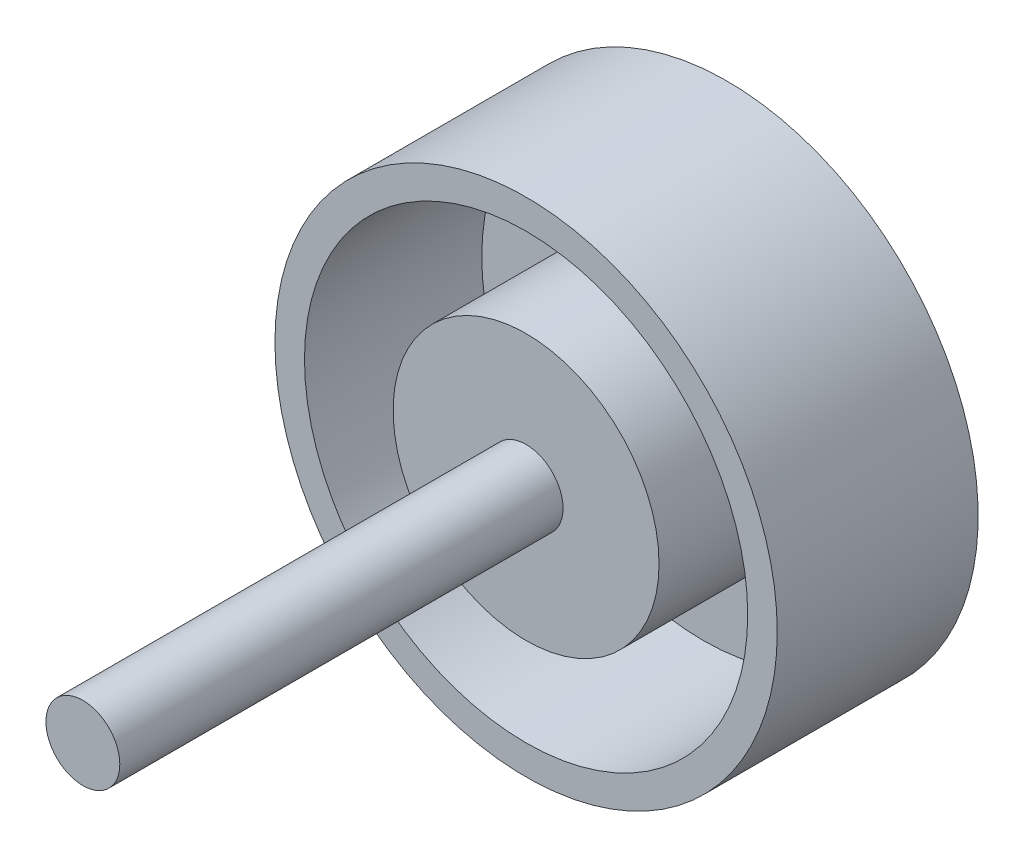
ISO-10303-21;
HEADER;
FILE_DESCRIPTION(('STEP AP214'),'2;1');
FILE_NAME('part.step','',(''),(''),'','','');
FILE_SCHEMA(('AUTOMOTIVE_DESIGN { 1 0 10303 214 1 1 1 1 }'));
ENDSEC;
DATA;
#1=APPLICATION_CONTEXT('core data for automotive mechanical design processes');
#2=APPLICATION_PROTOCOL_DEFINITION('international standard','automotive_design',2000,#1);
#3=PRODUCT_CONTEXT('',#1,'mechanical');
#4=PRODUCT('Part','Part','',(#3));
#5=PRODUCT_RELATED_PRODUCT_CATEGORY('part','',(#4));
#6=PRODUCT_DEFINITION_FORMATION('','',#4);
#7=PRODUCT_DEFINITION_CONTEXT('part definition',#1,'design');
#8=PRODUCT_DEFINITION('design','',#6,#7);
#9=PRODUCT_DEFINITION_SHAPE('','',#8);
#10=(LENGTH_UNIT() NAMED_UNIT(*) SI_UNIT(.MILLI.,.METRE.));
#11=(NAMED_UNIT(*) PLANE_ANGLE_UNIT() SI_UNIT($,.RADIAN.));
#12=(NAMED_UNIT(*) SI_UNIT($,.STERADIAN.) SOLID_ANGLE_UNIT());
#13=UNCERTAINTY_MEASURE_WITH_UNIT(LENGTH_MEASURE(1.E-05),#10,'distance_accuracy_value','');
#14=(GEOMETRIC_REPRESENTATION_CONTEXT(3) GLOBAL_UNCERTAINTY_ASSIGNED_CONTEXT((#13)) GLOBAL_UNIT_ASSIGNED_CONTEXT((#10,
#11,#12)) REPRESENTATION_CONTEXT('',''));
#15=CARTESIAN_POINT('',(0.,0.,0.));
#16=DIRECTION('',(0.,0.,1.));
#17=DIRECTION('',(1.,0.,0.));
#18=AXIS2_PLACEMENT_3D('',#15,#16,#17);
#19=CARTESIAN_POINT('',(0.,0.,7.));
#20=DIRECTION('',(0.,0.,-1.));
#21=DIRECTION('',(-1.,0.,0.));
#22=AXIS2_PLACEMENT_3D('',#19,#20,#21);
#23=CYLINDRICAL_SURFACE('',#22,8.5);
#24=CARTESIAN_POINT('',(0.,0.,7.));
#25=DIRECTION('',(0.,0.,1.));
#26=DIRECTION('',(1.,0.,0.));
#27=AXIS2_PLACEMENT_3D('',#24,#25,#26);
#28=CIRCLE('',#27,8.5);
#29=CARTESIAN_POINT('',(8.5,0.,7.));
#30=VERTEX_POINT('',#29);
#31=EDGE_CURVE('E10',#30,#30,#28,.T.);
#32=ORIENTED_EDGE('',*,*,#31,.F.);
#33=EDGE_LOOP('',(#32));
#34=FACE_BOUND('',#33,.T.);
#35=CARTESIAN_POINT('',(0.,0.,0.2));
#36=DIRECTION('',(0.,0.,-1.));
#37=DIRECTION('',(-1.,0.,0.));
#38=AXIS2_PLACEMENT_3D('',#35,#36,#37);
#39=CIRCLE('',#38,8.5);
#40=CARTESIAN_POINT('',(-8.5,0.,0.2));
#41=VERTEX_POINT('',#40);
#42=EDGE_CURVE('E62',#41,#41,#39,.T.);
#43=ORIENTED_EDGE('',*,*,#42,.F.);
#44=EDGE_LOOP('',(#43));
#45=FACE_BOUND('',#44,.T.);
#46=ADVANCED_FACE('F30',(#34,#45),#23,.T.);
#47=CARTESIAN_POINT('',(0.,0.,7.));
#48=DIRECTION('',(0.,0.,1.));
#49=DIRECTION('',(1.,0.,0.));
#50=AXIS2_PLACEMENT_3D('',#47,#48,#49);
#51=PLANE('',#50);
#52=CARTESIAN_POINT('',(0.,0.,7.));
#53=DIRECTION('',(0.,0.,1.));
#54=DIRECTION('',(1.,0.,0.));
#55=AXIS2_PLACEMENT_3D('',#52,#53,#54);
#56=CIRCLE('',#55,4.5);
#57=CARTESIAN_POINT('',(4.5,0.,7.));
#58=VERTEX_POINT('',#57);
#59=EDGE_CURVE('E49',#58,#58,#56,.T.);
#60=ORIENTED_EDGE('',*,*,#59,.T.);
#61=EDGE_LOOP('',(#60));
#62=FACE_BOUND('',#61,.T.);
#63=CARTESIAN_POINT('',(0.,0.,7.));
#64=DIRECTION('',(0.,0.,1.));
#65=DIRECTION('',(1.,0.,0.));
#66=AXIS2_PLACEMENT_3D('',#63,#64,#65);
#67=CIRCLE('',#66,1.25);
#68=CARTESIAN_POINT('',(1.25,0.,7.));
#69=VERTEX_POINT('',#68);
#70=EDGE_CURVE('E53',#69,#69,#67,.T.);
#71=ORIENTED_EDGE('',*,*,#70,.F.);
#72=EDGE_LOOP('',(#71));
#73=FACE_BOUND('',#72,.T.);
#74=ADVANCED_FACE('F85',(#62,#73),#51,.T.);
#75=CARTESIAN_POINT('',(0.,0.,7.));
#76=DIRECTION('',(0.,0.,1.));
#77=DIRECTION('',(1.,0.,0.));
#78=AXIS2_PLACEMENT_3D('',#75,#76,#77);
#79=CIRCLE('',#78,7.5);
#80=CARTESIAN_POINT('',(7.5,0.,7.));
#81=VERTEX_POINT('',#80);
#82=EDGE_CURVE('E40',#81,#81,#79,.T.);
#83=ORIENTED_EDGE('',*,*,#82,.F.);
#84=EDGE_LOOP('',(#83));
#85=FACE_BOUND('',#84,.T.);
#86=ORIENTED_EDGE('',*,*,#31,.T.);
#87=EDGE_LOOP('',(#86));
#88=FACE_BOUND('',#87,.T.);
#89=ADVANCED_FACE('F90',(#85,#88),#51,.T.);
#90=CARTESIAN_POINT('',(0.,0.,1.));
#91=DIRECTION('',(0.,0.,1.));
#92=DIRECTION('',(1.,0.,0.));
#93=AXIS2_PLACEMENT_3D('',#90,#91,#92);
#94=CYLINDRICAL_SURFACE('',#93,7.5);
#95=CARTESIAN_POINT('',(0.,0.,1.));
#96=DIRECTION('',(0.,0.,1.));
#97=DIRECTION('',(1.,0.,0.));
#98=AXIS2_PLACEMENT_3D('',#95,#96,#97);
#99=CIRCLE('',#98,7.5);
#100=CARTESIAN_POINT('',(7.5,0.,1.));
#101=VERTEX_POINT('',#100);
#102=EDGE_CURVE('E36',#101,#101,#99,.T.);
#103=ORIENTED_EDGE('',*,*,#102,.F.);
#104=EDGE_LOOP('',(#103));
#105=FACE_BOUND('',#104,.T.);
#106=ORIENTED_EDGE('',*,*,#82,.T.);
#107=EDGE_LOOP('',(#106));
#108=FACE_BOUND('',#107,.T.);
#109=ADVANCED_FACE('F95',(#105,#108),#94,.F.);
#110=CARTESIAN_POINT('',(0.,0.,1.));
#111=DIRECTION('',(0.,0.,1.));
#112=DIRECTION('',(1.,0.,0.));
#113=AXIS2_PLACEMENT_3D('',#110,#111,#112);
#114=PLANE('',#113);
#115=CARTESIAN_POINT('',(0.,0.,1.));
#116=DIRECTION('',(0.,0.,1.));
#117=DIRECTION('',(1.,0.,0.));
#118=AXIS2_PLACEMENT_3D('',#115,#116,#117);
#119=CIRCLE('',#118,4.5);
#120=CARTESIAN_POINT('',(4.5,0.,1.));
#121=VERTEX_POINT('',#120);
#122=EDGE_CURVE('E44',#121,#121,#119,.T.);
#123=ORIENTED_EDGE('',*,*,#122,.F.);
#124=EDGE_LOOP('',(#123));
#125=FACE_BOUND('',#124,.T.);
#126=ORIENTED_EDGE('',*,*,#102,.T.);
#127=EDGE_LOOP('',(#126));
#128=FACE_BOUND('',#127,.T.);
#129=ADVANCED_FACE('F106',(#125,#128),#114,.T.);
#130=CARTESIAN_POINT('',(0.,0.,1.));
#131=DIRECTION('',(0.,0.,1.));
#132=DIRECTION('',(1.,0.,0.));
#133=AXIS2_PLACEMENT_3D('',#130,#131,#132);
#134=CYLINDRICAL_SURFACE('',#133,4.5);
#135=ORIENTED_EDGE('',*,*,#122,.T.);
#136=EDGE_LOOP('',(#135));
#137=FACE_BOUND('',#136,.T.);
#138=ORIENTED_EDGE('',*,*,#59,.F.);
#139=EDGE_LOOP('',(#138));
#140=FACE_BOUND('',#139,.T.);
#141=ADVANCED_FACE('F110',(#137,#140),#134,.T.);
#142=CARTESIAN_POINT('',(0.,0.,22.));
#143=DIRECTION('',(0.,0.,-1.));
#144=DIRECTION('',(-1.,0.,0.));
#145=AXIS2_PLACEMENT_3D('',#142,#143,#144);
#146=CYLINDRICAL_SURFACE('',#145,1.25);
#147=CARTESIAN_POINT('',(0.,0.,22.));
#148=DIRECTION('',(0.,0.,1.));
#149=DIRECTION('',(1.,0.,0.));
#150=AXIS2_PLACEMENT_3D('',#147,#148,#149);
#151=CIRCLE('',#150,1.25);
#152=CARTESIAN_POINT('',(1.25,0.,22.));
#153=VERTEX_POINT('',#152);
#154=EDGE_CURVE('E52',#153,#153,#151,.T.);
#155=ORIENTED_EDGE('',*,*,#154,.F.);
#156=EDGE_LOOP('',(#155));
#157=FACE_BOUND('',#156,.T.);
#158=ORIENTED_EDGE('',*,*,#70,.T.);
#159=EDGE_LOOP('',(#158));
#160=FACE_BOUND('',#159,.T.);
#161=ADVANCED_FACE('F114',(#157,#160),#146,.T.);
#162=CARTESIAN_POINT('',(0.,0.,22.));
#163=DIRECTION('',(0.,0.,1.));
#164=DIRECTION('',(1.,0.,0.));
#165=AXIS2_PLACEMENT_3D('',#162,#163,#164);
#166=PLANE('',#165);
#167=ORIENTED_EDGE('',*,*,#154,.T.);
#168=EDGE_LOOP('',(#167));
#169=FACE_BOUND('',#168,.T.);
#170=ADVANCED_FACE('F80',(#169),#166,.T.);
#171=CARTESIAN_POINT('',(0.,0.,0.2));
#172=DIRECTION('',(0.,0.,-1.));
#173=DIRECTION('',(-1.,0.,0.));
#174=AXIS2_PLACEMENT_3D('',#171,#172,#173);
#175=PLANE('',#174);
#176=CARTESIAN_POINT('',(0.,0.,0.2));
#177=DIRECTION('',(0.,0.,-1.));
#178=DIRECTION('',(-1.,0.,0.));
#179=AXIS2_PLACEMENT_3D('',#176,#177,#178);
#180=CIRCLE('',#179,7.);
#181=CARTESIAN_POINT('',(-7.,0.,0.2));
#182=VERTEX_POINT('',#181);
#183=EDGE_CURVE('E67',#182,#182,#180,.T.);
#184=ORIENTED_EDGE('',*,*,#183,.F.);
#185=EDGE_LOOP('',(#184));
#186=FACE_BOUND('',#185,.T.);
#187=ORIENTED_EDGE('',*,*,#42,.T.);
#188=EDGE_LOOP('',(#187));
#189=FACE_BOUND('',#188,.T.);
#190=ADVANCED_FACE('F77',(#186,#189),#175,.T.);
#191=CARTESIAN_POINT('',(0.,0.,0.2));
#192=DIRECTION('',(0.,0.,-1.));
#193=DIRECTION('',(-1.,0.,0.));
#194=AXIS2_PLACEMENT_3D('',#191,#192,#193);
#195=CYLINDRICAL_SURFACE('',#194,7.);
#196=ORIENTED_EDGE('',*,*,#183,.T.);
#197=EDGE_LOOP('',(#196));
#198=FACE_BOUND('',#197,.T.);
#199=CARTESIAN_POINT('',(0.,0.,0.));
#200=DIRECTION('',(0.,0.,-1.));
#201=DIRECTION('',(-1.,0.,0.));
#202=AXIS2_PLACEMENT_3D('',#199,#200,#201);
#203=CIRCLE('',#202,7.);
#204=CARTESIAN_POINT('',(-7.,0.,0.));
#205=VERTEX_POINT('',#204);
#206=EDGE_CURVE('E68',#205,#205,#203,.T.);
#207=ORIENTED_EDGE('',*,*,#206,.F.);
#208=EDGE_LOOP('',(#207));
#209=FACE_BOUND('',#208,.T.);
#210=ADVANCED_FACE('F74',(#198,#209),#195,.T.);
#211=CARTESIAN_POINT('',(0.,0.,0.5));
#212=DIRECTION('',(0.,0.,-1.));
#213=DIRECTION('',(-1.,0.,0.));
#214=AXIS2_PLACEMENT_3D('',#211,#212,#213);
#215=PLANE('',#214);
#216=CARTESIAN_POINT('',(0.,0.,0.5));
#217=DIRECTION('',(0.,0.,-1.));
#218=DIRECTION('',(-1.,0.,0.));
#219=AXIS2_PLACEMENT_3D('',#216,#217,#218);
#220=CIRCLE('',#219,6.);
#221=CARTESIAN_POINT('',(-6.,0.,0.5));
#222=VERTEX_POINT('',#221);
#223=EDGE_CURVE('E56',#222,#222,#220,.T.);
#224=ORIENTED_EDGE('',*,*,#223,.T.);
#225=EDGE_LOOP('',(#224));
#226=FACE_BOUND('',#225,.T.);
#227=ADVANCED_FACE('F124',(#226),#215,.T.);
#228=CARTESIAN_POINT('',(0.,0.,0.5));
#229=DIRECTION('',(0.,0.,-1.));
#230=DIRECTION('',(-1.,0.,0.));
#231=AXIS2_PLACEMENT_3D('',#228,#229,#230);
#232=CYLINDRICAL_SURFACE('',#231,6.);
#233=ORIENTED_EDGE('',*,*,#223,.F.);
#234=EDGE_LOOP('',(#233));
#235=FACE_BOUND('',#234,.T.);
#236=CARTESIAN_POINT('',(0.,0.,0.));
#237=DIRECTION('',(0.,0.,-1.));
#238=DIRECTION('',(-1.,0.,0.));
#239=AXIS2_PLACEMENT_3D('',#236,#237,#238);
#240=CIRCLE('',#239,6.);
#241=CARTESIAN_POINT('',(-6.,0.,0.));
#242=VERTEX_POINT('',#241);
#243=EDGE_CURVE('E59',#242,#242,#240,.T.);
#244=ORIENTED_EDGE('',*,*,#243,.T.);
#245=EDGE_LOOP('',(#244));
#246=FACE_BOUND('',#245,.T.);
#247=ADVANCED_FACE('F102',(#235,#246),#232,.F.);
#248=CARTESIAN_POINT('',(0.,0.,0.));
#249=DIRECTION('',(0.,0.,1.));
#250=DIRECTION('',(1.,0.,0.));
#251=AXIS2_PLACEMENT_3D('',#248,#249,#250);
#252=PLANE('',#251);
#253=ORIENTED_EDGE('',*,*,#243,.F.);
#254=EDGE_LOOP('',(#253));
#255=FACE_BOUND('',#254,.T.);
#256=ORIENTED_EDGE('',*,*,#206,.T.);
#257=EDGE_LOOP('',(#256));
#258=FACE_BOUND('',#257,.T.);
#259=ADVANCED_FACE('F99',(#255,#258),#252,.F.);
#260=CLOSED_SHELL('',(#46,#74,#89,#109,#129,#141,#161,#170,#190,#210,#227,#247,#259));
#261=MANIFOLD_SOLID_BREP('B2',#260);
#262=ADVANCED_BREP_SHAPE_REPRESENTATION('',(#18,#261),#14);
#263=SHAPE_DEFINITION_REPRESENTATION(#9,#262);
ENDSEC;
END-ISO-10303-21;
